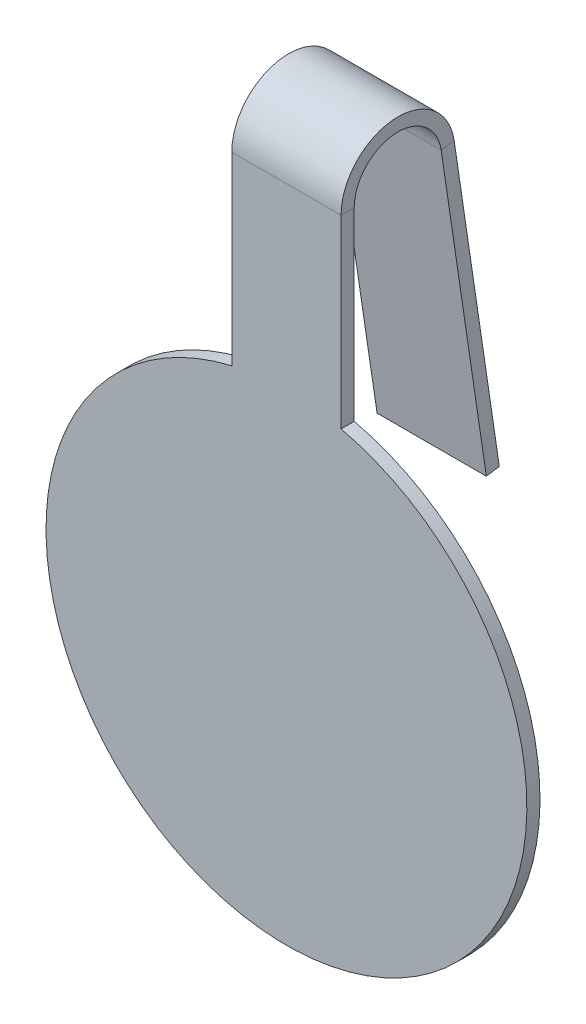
ISO-10303-21;
HEADER;
FILE_DESCRIPTION(('STEP AP214'),'2;1');
FILE_NAME('part.step','',(''),(''),'','','');
FILE_SCHEMA(('AUTOMOTIVE_DESIGN { 1 0 10303 214 1 1 1 1 }'));
ENDSEC;
DATA;
#1=APPLICATION_CONTEXT('core data for automotive mechanical design processes');
#2=APPLICATION_PROTOCOL_DEFINITION('international standard','automotive_design',2000,#1);
#3=PRODUCT_CONTEXT('',#1,'mechanical');
#4=PRODUCT('Part','Part','',(#3));
#5=PRODUCT_RELATED_PRODUCT_CATEGORY('part','',(#4));
#6=PRODUCT_DEFINITION_FORMATION('','',#4);
#7=PRODUCT_DEFINITION_CONTEXT('part definition',#1,'design');
#8=PRODUCT_DEFINITION('design','',#6,#7);
#9=PRODUCT_DEFINITION_SHAPE('','',#8);
#10=(LENGTH_UNIT() NAMED_UNIT(*) SI_UNIT(.MILLI.,.METRE.));
#11=(NAMED_UNIT(*) PLANE_ANGLE_UNIT() SI_UNIT($,.RADIAN.));
#12=(NAMED_UNIT(*) SI_UNIT($,.STERADIAN.) SOLID_ANGLE_UNIT());
#13=UNCERTAINTY_MEASURE_WITH_UNIT(LENGTH_MEASURE(1.E-05),#10,'distance_accuracy_value','');
#14=(GEOMETRIC_REPRESENTATION_CONTEXT(3) GLOBAL_UNCERTAINTY_ASSIGNED_CONTEXT((#13)) GLOBAL_UNIT_ASSIGNED_CONTEXT((#10,
#11,#12)) REPRESENTATION_CONTEXT('',''));
#15=CARTESIAN_POINT('',(0.,0.,0.));
#16=DIRECTION('',(0.,0.,1.));
#17=DIRECTION('',(1.,0.,0.));
#18=AXIS2_PLACEMENT_3D('',#15,#16,#17);
#19=CARTESIAN_POINT('',(0.,286.264732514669,-1.17231105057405));
#20=DIRECTION('',(0.,0.146548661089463,-0.989203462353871));
#21=DIRECTION('',(1.,0.,0.));
#22=AXIS2_PLACEMENT_3D('',#19,#20,#21);
#23=PLANE('',#22);
#24=DIRECTION('',(0.,-0.989203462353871,-0.146548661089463));
#25=VECTOR('',#24,1.);
#26=CARTESIAN_POINT('',(15.875,218.977029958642,-11.140859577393));
#27=LINE('',#26,#25);
#28=CARTESIAN_POINT('',(15.875,123.653365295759,-25.2628839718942));
#29=VERTEX_POINT('',#28);
#30=CARTESIAN_POINT('',(15.875,35.007053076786,-38.3956709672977));
#31=VERTEX_POINT('',#30);
#32=EDGE_CURVE('E51',#29,#31,#27,.T.);
#33=ORIENTED_EDGE('',*,*,#32,.F.);
#34=DIRECTION('',(-1.,0.,0.));
#35=VECTOR('',#34,1.);
#36=CARTESIAN_POINT('',(0.,123.653365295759,-25.2628839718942));
#37=LINE('',#36,#35);
#38=CARTESIAN_POINT('',(-15.875,123.653365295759,-25.2628839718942));
#39=VERTEX_POINT('',#38);
#40=EDGE_CURVE('E43',#29,#39,#37,.T.);
#41=ORIENTED_EDGE('',*,*,#40,.T.);
#42=DIRECTION('',(0.,0.989203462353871,0.146548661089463));
#43=VECTOR('',#42,1.);
#44=CARTESIAN_POINT('',(-15.875,218.977029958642,-11.140859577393));
#45=LINE('',#44,#43);
#46=CARTESIAN_POINT('',(-15.875,35.007053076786,-38.3956709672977));
#47=VERTEX_POINT('',#46);
#48=EDGE_CURVE('E58',#47,#39,#45,.T.);
#49=ORIENTED_EDGE('',*,*,#48,.F.);
#50=DIRECTION('',(-1.,0.,0.));
#51=VECTOR('',#50,1.);
#52=CARTESIAN_POINT('',(15.875,35.007053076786,-38.3956709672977));
#53=LINE('',#52,#51);
#54=EDGE_CURVE('E159',#31,#47,#53,.T.);
#55=ORIENTED_EDGE('',*,*,#54,.F.);
#56=EDGE_LOOP('',(#33,#41,#49,#55));
#57=FACE_BOUND('',#56,.T.);
#58=ADVANCED_FACE('F34',(#57),#23,.F.);
#59=CARTESIAN_POINT('',(-15.875,219.535380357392,-14.9097247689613));
#60=DIRECTION('',(1.,0.,0.));
#61=DIRECTION('',(0.,-0.146548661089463,0.989203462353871));
#62=AXIS2_PLACEMENT_3D('',#59,#60,#61);
#63=PLANE('',#62);
#64=ORIENTED_EDGE('',*,*,#48,.T.);
#65=DIRECTION('',(0.,0.14654866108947,-0.98920346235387));
#66=VECTOR('',#65,1.);
#67=CARTESIAN_POINT('',(-15.875,124.21171569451,-29.0317491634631));
#68=LINE('',#67,#66);
#69=CARTESIAN_POINT('',(-15.875,124.211715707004,-29.0317492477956));
#70=VERTEX_POINT('',#69);
#71=EDGE_CURVE('E170',#39,#70,#68,.T.);
#72=ORIENTED_EDGE('',*,*,#71,.T.);
#73=DIRECTION('',(0.,0.989203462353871,0.146548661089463));
#74=VECTOR('',#73,1.);
#75=CARTESIAN_POINT('',(-15.875,219.535380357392,-14.9097247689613));
#76=LINE('',#75,#74);
#77=CARTESIAN_POINT('',(-15.875,35.5654034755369,-42.1645361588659));
#78=VERTEX_POINT('',#77);
#79=EDGE_CURVE('E163',#78,#70,#76,.T.);
#80=ORIENTED_EDGE('',*,*,#79,.F.);
#81=DIRECTION('',(0.,-0.146548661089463,0.989203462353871));
#82=VECTOR('',#81,1.);
#83=CARTESIAN_POINT('',(-15.875,35.5654034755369,-42.1645361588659));
#84=LINE('',#83,#82);
#85=EDGE_CURVE('E164',#78,#47,#84,.T.);
#86=ORIENTED_EDGE('',*,*,#85,.T.);
#87=EDGE_LOOP('',(#64,#72,#80,#86));
#88=FACE_BOUND('',#87,.T.);
#89=ADVANCED_FACE('F181',(#88),#63,.F.);
#90=CARTESIAN_POINT('',(15.875,219.535380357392,-14.9097247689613));
#91=DIRECTION('',(-1.,0.,0.));
#92=DIRECTION('',(0.,0.146548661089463,-0.989203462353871));
#93=AXIS2_PLACEMENT_3D('',#90,#91,#92);
#94=PLANE('',#93);
#95=DIRECTION('',(0.,-0.989203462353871,-0.146548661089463));
#96=VECTOR('',#95,1.);
#97=CARTESIAN_POINT('',(15.875,219.535380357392,-14.9097247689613));
#98=LINE('',#97,#96);
#99=CARTESIAN_POINT('',(15.875,124.21171569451,-29.0317491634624));
#100=VERTEX_POINT('',#99);
#101=CARTESIAN_POINT('',(15.875,35.5654034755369,-42.1645361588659));
#102=VERTEX_POINT('',#101);
#103=EDGE_CURVE('E38',#100,#102,#98,.T.);
#104=ORIENTED_EDGE('',*,*,#103,.F.);
#105=DIRECTION('',(0.,-0.14654866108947,0.98920346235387));
#106=VECTOR('',#105,1.);
#107=CARTESIAN_POINT('',(15.875,124.21171569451,-29.0317491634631));
#108=LINE('',#107,#106);
#109=EDGE_CURVE('E12',#100,#29,#108,.T.);
#110=ORIENTED_EDGE('',*,*,#109,.T.);
#111=ORIENTED_EDGE('',*,*,#32,.T.);
#112=DIRECTION('',(0.,-0.146548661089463,0.989203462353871));
#113=VECTOR('',#112,1.);
#114=CARTESIAN_POINT('',(15.875,35.5654034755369,-42.1645361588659));
#115=LINE('',#114,#113);
#116=EDGE_CURVE('E166',#102,#31,#115,.T.);
#117=ORIENTED_EDGE('',*,*,#116,.F.);
#118=EDGE_LOOP('',(#104,#110,#111,#117));
#119=FACE_BOUND('',#118,.T.);
#120=ADVANCED_FACE('F36',(#119),#94,.F.);
#121=CARTESIAN_POINT('',(15.875,35.5654034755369,-42.1645361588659));
#122=DIRECTION('',(0.,0.989203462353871,0.146548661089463));
#123=DIRECTION('',(0.,-0.146548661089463,0.989203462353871));
#124=AXIS2_PLACEMENT_3D('',#121,#122,#123);
#125=PLANE('',#124);
#126=ORIENTED_EDGE('',*,*,#54,.T.);
#127=ORIENTED_EDGE('',*,*,#85,.F.);
#128=DIRECTION('',(-1.,0.,0.));
#129=VECTOR('',#128,1.);
#130=CARTESIAN_POINT('',(15.875,35.5654034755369,-42.1645361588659));
#131=LINE('',#130,#129);
#132=EDGE_CURVE('E161',#102,#78,#131,.T.);
#133=ORIENTED_EDGE('',*,*,#132,.F.);
#134=ORIENTED_EDGE('',*,*,#116,.T.);
#135=EDGE_LOOP('',(#126,#127,#133,#134));
#136=FACE_BOUND('',#135,.T.);
#137=ADVANCED_FACE('F208',(#136),#125,.F.);
#138=CARTESIAN_POINT('',(0.,286.82308291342,-4.9411762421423));
#139=DIRECTION('',(0.,0.146548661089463,-0.989203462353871));
#140=DIRECTION('',(1.,0.,0.));
#141=AXIS2_PLACEMENT_3D('',#138,#139,#140);
#142=PLANE('',#141);
#143=DIRECTION('',(-1.,0.,0.));
#144=VECTOR('',#143,1.);
#145=CARTESIAN_POINT('',(0.,124.21171569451,-29.0317491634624));
#146=LINE('',#145,#144);
#147=EDGE_CURVE('E137',#100,#70,#146,.T.);
#148=ORIENTED_EDGE('',*,*,#147,.F.);
#149=ORIENTED_EDGE('',*,*,#103,.T.);
#150=ORIENTED_EDGE('',*,*,#132,.T.);
#151=ORIENTED_EDGE('',*,*,#79,.T.);
#152=EDGE_LOOP('',(#148,#149,#150,#151));
#153=FACE_BOUND('',#152,.T.);
#154=ADVANCED_FACE('F177',(#153),#142,.T.);
#155=CARTESIAN_POINT('',(0.,0.,3.81));
#156=DIRECTION('',(0.,0.,-1.));
#157=DIRECTION('',(-1.,0.,0.));
#158=AXIS2_PLACEMENT_3D('',#155,#156,#157);
#159=CYLINDRICAL_SURFACE('',#158,69.85);
#160=CARTESIAN_POINT('',(0.,0.,0.));
#161=DIRECTION('',(0.,0.,1.));
#162=DIRECTION('',(1.,0.,0.));
#163=AXIS2_PLACEMENT_3D('',#160,#161,#162);
#164=CIRCLE('',#163,69.85);
#165=CARTESIAN_POINT('',(-15.875,68.0221057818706,0.));
#166=VERTEX_POINT('',#165);
#167=CARTESIAN_POINT('',(15.875,68.0221057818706,0.));
#168=VERTEX_POINT('',#167);
#169=EDGE_CURVE('E132',#166,#168,#164,.T.);
#170=ORIENTED_EDGE('',*,*,#169,.T.);
#171=DIRECTION('',(0.,0.,-1.));
#172=VECTOR('',#171,1.);
#173=CARTESIAN_POINT('',(15.875,68.0221057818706,3.81));
#174=LINE('',#173,#172);
#175=CARTESIAN_POINT('',(15.875,68.0221057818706,3.81));
#176=VERTEX_POINT('',#175);
#177=EDGE_CURVE('E148',#176,#168,#174,.T.);
#178=ORIENTED_EDGE('',*,*,#177,.F.);
#179=CARTESIAN_POINT('',(0.,0.,3.81));
#180=DIRECTION('',(0.,0.,1.));
#181=DIRECTION('',(1.,0.,0.));
#182=AXIS2_PLACEMENT_3D('',#179,#180,#181);
#183=CIRCLE('',#182,69.85);
#184=CARTESIAN_POINT('',(-15.875,68.0221057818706,3.81));
#185=VERTEX_POINT('',#184);
#186=EDGE_CURVE('E112',#185,#176,#183,.T.);
#187=ORIENTED_EDGE('',*,*,#186,.F.);
#188=DIRECTION('',(0.,0.,-1.));
#189=VECTOR('',#188,1.);
#190=CARTESIAN_POINT('',(-15.875,68.0221057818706,3.81));
#191=LINE('',#190,#189);
#192=EDGE_CURVE('E108',#185,#166,#191,.T.);
#193=ORIENTED_EDGE('',*,*,#192,.T.);
#194=EDGE_LOOP('',(#170,#178,#187,#193));
#195=FACE_BOUND('',#194,.T.);
#196=ADVANCED_FACE('F200',(#195),#159,.T.);
#197=CARTESIAN_POINT('',(0.,0.,3.81));
#198=DIRECTION('',(0.,0.,1.));
#199=DIRECTION('',(1.,0.,0.));
#200=AXIS2_PLACEMENT_3D('',#197,#198,#199);
#201=PLANE('',#200);
#202=DIRECTION('',(0.,1.,0.));
#203=VECTOR('',#202,1.);
#204=CARTESIAN_POINT('',(15.875,68.0221057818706,3.81));
#205=LINE('',#204,#203);
#206=CARTESIAN_POINT('',(15.875,121.792197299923,3.81));
#207=VERTEX_POINT('',#206);
#208=EDGE_CURVE('E117',#176,#207,#205,.T.);
#209=ORIENTED_EDGE('',*,*,#208,.T.);
#210=DIRECTION('',(-1.,0.,0.));
#211=VECTOR('',#210,1.);
#212=CARTESIAN_POINT('',(0.,121.792197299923,3.81));
#213=LINE('',#212,#211);
#214=CARTESIAN_POINT('',(-15.875,121.792197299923,3.81000008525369));
#215=VERTEX_POINT('',#214);
#216=EDGE_CURVE('E113',#207,#215,#213,.T.);
#217=ORIENTED_EDGE('',*,*,#216,.T.);
#218=DIRECTION('',(0.,-1.,0.));
#219=VECTOR('',#218,1.);
#220=CARTESIAN_POINT('',(-15.875,68.0221057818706,3.81));
#221=LINE('',#220,#219);
#222=EDGE_CURVE('E101',#215,#185,#221,.T.);
#223=ORIENTED_EDGE('',*,*,#222,.T.);
#224=ORIENTED_EDGE('',*,*,#186,.T.);
#225=EDGE_LOOP('',(#209,#217,#223,#224));
#226=FACE_BOUND('',#225,.T.);
#227=ADVANCED_FACE('F116',(#226),#201,.T.);
#228=CARTESIAN_POINT('',(-15.875,68.0221057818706,3.81));
#229=DIRECTION('',(1.,0.,0.));
#230=DIRECTION('',(0.,0.,-1.));
#231=AXIS2_PLACEMENT_3D('',#228,#229,#230);
#232=PLANE('',#231);
#233=DIRECTION('',(0.,0.,1.));
#234=VECTOR('',#233,1.);
#235=CARTESIAN_POINT('',(-15.875,121.792197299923,3.81000000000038));
#236=LINE('',#235,#234);
#237=CARTESIAN_POINT('',(-15.875,121.792197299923,0.));
#238=VERTEX_POINT('',#237);
#239=EDGE_CURVE('E105',#238,#215,#236,.T.);
#240=ORIENTED_EDGE('',*,*,#239,.F.);
#241=DIRECTION('',(0.,-1.,0.));
#242=VECTOR('',#241,1.);
#243=CARTESIAN_POINT('',(-15.875,68.0221057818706,0.));
#244=LINE('',#243,#242);
#245=EDGE_CURVE('E151',#238,#166,#244,.T.);
#246=ORIENTED_EDGE('',*,*,#245,.T.);
#247=ORIENTED_EDGE('',*,*,#192,.F.);
#248=ORIENTED_EDGE('',*,*,#222,.F.);
#249=EDGE_LOOP('',(#240,#246,#247,#248));
#250=FACE_BOUND('',#249,.T.);
#251=ADVANCED_FACE('F103',(#250),#232,.F.);
#252=CARTESIAN_POINT('',(0.,0.,0.));
#253=DIRECTION('',(0.,0.,1.));
#254=DIRECTION('',(1.,0.,0.));
#255=AXIS2_PLACEMENT_3D('',#252,#253,#254);
#256=PLANE('',#255);
#257=DIRECTION('',(-1.,0.,0.));
#258=VECTOR('',#257,1.);
#259=CARTESIAN_POINT('',(0.,121.792197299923,0.));
#260=LINE('',#259,#258);
#261=CARTESIAN_POINT('',(15.875,121.792197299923,0.));
#262=VERTEX_POINT('',#261);
#263=EDGE_CURVE('E133',#262,#238,#260,.T.);
#264=ORIENTED_EDGE('',*,*,#263,.F.);
#265=DIRECTION('',(0.,1.,0.));
#266=VECTOR('',#265,1.);
#267=CARTESIAN_POINT('',(15.875,68.0221057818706,0.));
#268=LINE('',#267,#266);
#269=EDGE_CURVE('E146',#168,#262,#268,.T.);
#270=ORIENTED_EDGE('',*,*,#269,.F.);
#271=ORIENTED_EDGE('',*,*,#169,.F.);
#272=ORIENTED_EDGE('',*,*,#245,.F.);
#273=EDGE_LOOP('',(#264,#270,#271,#272));
#274=FACE_BOUND('',#273,.T.);
#275=ADVANCED_FACE('F198',(#274),#256,.F.);
#276=CARTESIAN_POINT('',(15.875,68.0221057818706,3.81));
#277=DIRECTION('',(-1.,0.,0.));
#278=DIRECTION('',(0.,0.,1.));
#279=AXIS2_PLACEMENT_3D('',#276,#277,#278);
#280=PLANE('',#279);
#281=DIRECTION('',(0.,0.,-1.));
#282=VECTOR('',#281,1.);
#283=CARTESIAN_POINT('',(15.875,121.792197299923,3.81000000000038));
#284=LINE('',#283,#282);
#285=EDGE_CURVE('E138',#207,#262,#284,.T.);
#286=ORIENTED_EDGE('',*,*,#285,.F.);
#287=ORIENTED_EDGE('',*,*,#208,.F.);
#288=ORIENTED_EDGE('',*,*,#177,.T.);
#289=ORIENTED_EDGE('',*,*,#269,.T.);
#290=EDGE_LOOP('',(#286,#287,#288,#289));
#291=FACE_BOUND('',#290,.T.);
#292=ADVANCED_FACE('F194',(#291),#280,.F.);
#293=CARTESIAN_POINT('',(15.875,121.792197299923,-12.7000000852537));
#294=DIRECTION('',(1.,0.,0.));
#295=DIRECTION('',(0.,0.,-1.));
#296=AXIS2_PLACEMENT_3D('',#293,#294,#295);
#297=PLANE('',#296);
#298=ORIENTED_EDGE('',*,*,#285,.T.);
#299=CARTESIAN_POINT('',(15.875,121.792197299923,-12.7));
#300=DIRECTION('',(-1.,0.,0.));
#301=DIRECTION('',(0.,0.,1.));
#302=AXIS2_PLACEMENT_3D('',#299,#300,#301);
#303=CIRCLE('',#302,12.7000000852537);
#304=EDGE_CURVE('E188',#262,#29,#303,.T.);
#305=ORIENTED_EDGE('',*,*,#304,.T.);
#306=ORIENTED_EDGE('',*,*,#109,.F.);
#307=CARTESIAN_POINT('',(15.875,121.792197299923,-12.7000000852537));
#308=DIRECTION('',(-1.,0.,0.));
#309=DIRECTION('',(0.,0.,1.));
#310=AXIS2_PLACEMENT_3D('',#307,#308,#309);
#311=CIRCLE('',#310,16.5100000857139);
#312=EDGE_CURVE('E139',#207,#100,#311,.T.);
#313=ORIENTED_EDGE('',*,*,#312,.F.);
#314=EDGE_LOOP('',(#298,#305,#306,#313));
#315=FACE_BOUND('',#314,.T.);
#316=ADVANCED_FACE('F192',(#315),#297,.T.);
#317=CARTESIAN_POINT('',(-15.875,121.792197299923,-12.7000000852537));
#318=DIRECTION('',(-1.,0.,0.));
#319=DIRECTION('',(0.,0.,1.));
#320=AXIS2_PLACEMENT_3D('',#317,#318,#319);
#321=PLANE('',#320);
#322=CARTESIAN_POINT('',(-15.875,121.792197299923,-12.7));
#323=DIRECTION('',(-1.,0.,0.));
#324=DIRECTION('',(0.,0.,1.));
#325=AXIS2_PLACEMENT_3D('',#322,#323,#324);
#326=CIRCLE('',#325,12.7000000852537);
#327=EDGE_CURVE('E131',#39,#238,#326,.F.);
#328=ORIENTED_EDGE('',*,*,#327,.T.);
#329=ORIENTED_EDGE('',*,*,#239,.T.);
#330=CARTESIAN_POINT('',(-15.875,121.792197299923,-12.7000000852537));
#331=DIRECTION('',(1.,0.,0.));
#332=DIRECTION('',(0.,0.,-1.));
#333=AXIS2_PLACEMENT_3D('',#330,#331,#332);
#334=CIRCLE('',#333,16.5100000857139);
#335=EDGE_CURVE('E129',#70,#215,#334,.T.);
#336=ORIENTED_EDGE('',*,*,#335,.F.);
#337=ORIENTED_EDGE('',*,*,#71,.F.);
#338=EDGE_LOOP('',(#328,#329,#336,#337));
#339=FACE_BOUND('',#338,.T.);
#340=ADVANCED_FACE('F127',(#339),#321,.T.);
#341=CARTESIAN_POINT('',(53.2618531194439,121.792197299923,-12.7));
#342=DIRECTION('',(-1.,0.,0.));
#343=DIRECTION('',(0.,0.,1.));
#344=AXIS2_PLACEMENT_3D('',#341,#342,#343);
#345=CYLINDRICAL_SURFACE('',#344,16.5100000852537);
#346=ORIENTED_EDGE('',*,*,#147,.T.);
#347=ORIENTED_EDGE('',*,*,#335,.T.);
#348=ORIENTED_EDGE('',*,*,#216,.F.);
#349=ORIENTED_EDGE('',*,*,#312,.T.);
#350=EDGE_LOOP('',(#346,#347,#348,#349));
#351=FACE_BOUND('',#350,.T.);
#352=ADVANCED_FACE('F136',(#351),#345,.T.);
#353=CARTESIAN_POINT('',(53.2618531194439,121.792197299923,-12.7));
#354=DIRECTION('',(-1.,0.,0.));
#355=DIRECTION('',(0.,0.,1.));
#356=AXIS2_PLACEMENT_3D('',#353,#354,#355);
#357=CYLINDRICAL_SURFACE('',#356,12.7000000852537);
#358=ORIENTED_EDGE('',*,*,#40,.F.);
#359=ORIENTED_EDGE('',*,*,#304,.F.);
#360=ORIENTED_EDGE('',*,*,#263,.T.);
#361=ORIENTED_EDGE('',*,*,#327,.F.);
#362=EDGE_LOOP('',(#358,#359,#360,#361));
#363=FACE_BOUND('',#362,.T.);
#364=ADVANCED_FACE('F184',(#363),#357,.F.);
#365=CLOSED_SHELL('',(#58,#89,#120,#137,#154,#196,#227,#251,#275,#292,#316,#340,#352,#364));
#366=MANIFOLD_SOLID_BREP('B2',#365);
#367=ADVANCED_BREP_SHAPE_REPRESENTATION('',(#18,#366),#14);
#368=SHAPE_DEFINITION_REPRESENTATION(#9,#367);
ENDSEC;
END-ISO-10303-21;
